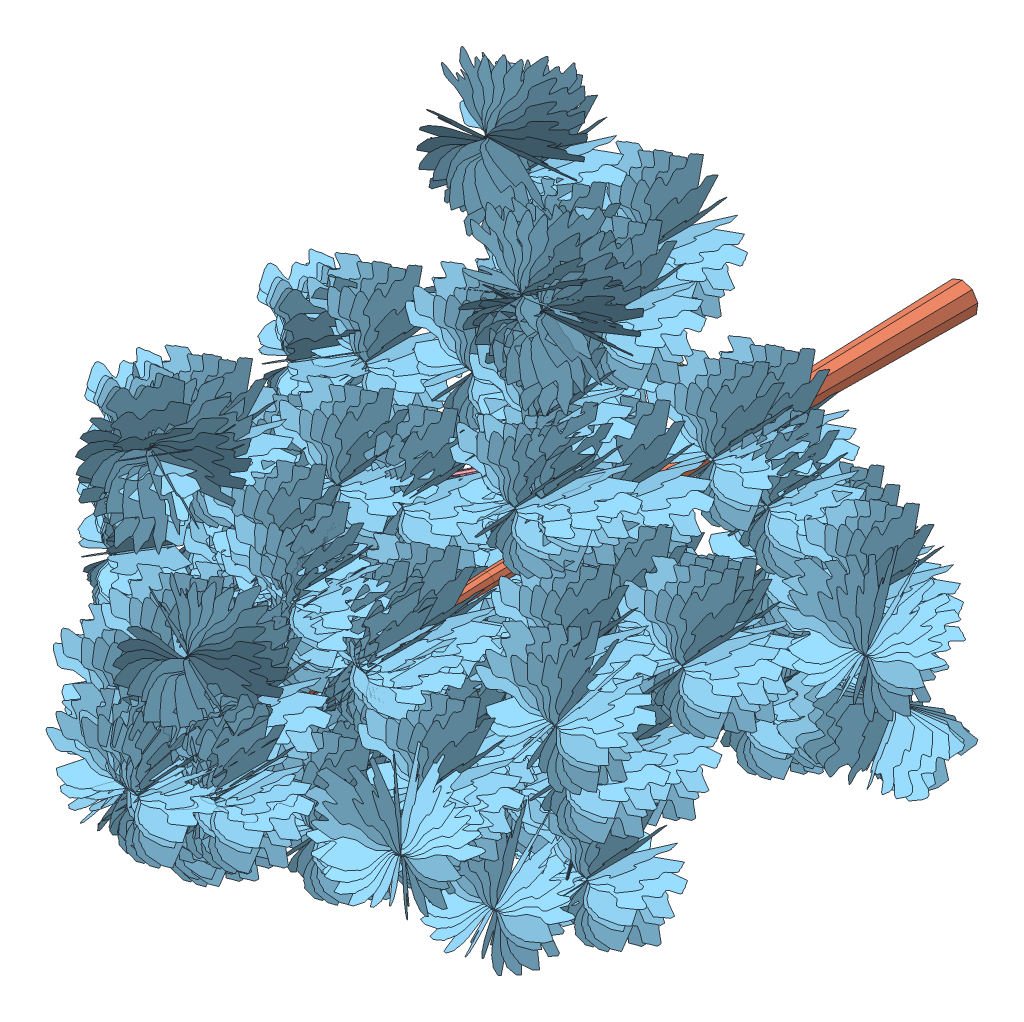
SolidWorks assembly Trees.sldasm, configuration Default (file format 5000). Lengths in mm.
Overall size (5115.62 5139.42 6788.33).
101 component instances, 5 part files, 0 mates.
Components (placement in the parent):
- ske23D-1: ske23D.sldasm [Default] at (-497.2906 -107.9055 -375.1821) size (2886.4 3755.53 5969.2)
  - trunk#1-1: trunk#1.sldprt [Default] at (784.9948 -772.8956 286.8127) x (-0.353553 0.612372 0.707107) z (0.353553 -0.612372 0.707107) size (412.95 799.64 2417.55)
  - trunk-1: trunk.sldprt [Default] at (279.3507 -134.9513 0.0105) size (239.05 254.8 5969.2)
  - trunk#1.003-1: trunk#1.003.sldprt [Default] at (335.3171 751.2508 -333.0644) x (-0.473959 -0.546062 0.690781) z (0.191833 0.701616 0.686247) size (412.95 799.64 2477.24)
  - trunk#1.006-1: trunk#1.006.sldprt [Default] at (-359.6606 -300.0581 111.819) x (0.866025 0 0.5) z (-0.5 0 0.866025) size (412.95 799.64 2865.24)
- Component#3-1: Component#3.sldprt [Default] at (-202.0016 -317.6253 3063.5759) size (1057.83 1130.53 472.26)
- Component#3-2: Component#3.sldprt [Default] at (-336.2489 -317.6253 3063.5759) x (0.965926 0 -0.258819) z (0.258819 0 0.965926) size (1057.83 1130.53 472.26)
- Component#3-3: Component#3.sldprt [Default] at (-199.8415 -326.0573 2845.5621) size (1057.83 1130.53 472.26)
- Component#3-4: Component#3.sldprt [Default] at (-218.4754 -566.1578 2737.9376) size (1057.83 1130.53 472.26)
- Component#3-5: Component#3.sldprt [Default] at (-210.7731 -636.3138 2687.2585) size (1057.83 1130.53 472.26)
- Component#3-6: Component#3.sldprt [Default] at (164.1784 -289.2611 2828.6491) size (1057.83 1130.53 472.26)
- Component#3-7: Component#3.sldprt [Default] at (39.4824 -289.2611 2828.6491) size (1057.83 1130.53 472.26)
- Component#3-8: Component#3.sldprt [Default] at (-210.7731 311.9722 2687.2585) x (1 0 0) z (0 0.866025 0.5) size (1057.83 1130.53 472.26)
- Component#3-9: Component#3.sldprt [Default] at (-210.7731 -133.4052 2321.8848) size (1057.83 1130.53 472.26)
- Component#3-10: Component#3.sldprt [Default] at (146.7954 -924.5314 2006.2702) size (1057.83 1130.53 472.26)
- Component#3-11: Component#3.sldprt [Default] at (906.1519 -578.8297 2214.8347) x (0.707107 0 -0.707107) z (0.707107 0 0.707107) size (1057.83 1130.53 472.26)
- Component#3-12: Component#3.sldprt [Default] at (-1200.8275 995.9938 2158.4783) x (0.866025 0 0.5) z (-0.5 0 0.866025) size (1057.83 1130.53 472.26)
- Component#3-13: Component#3.sldprt [Default] at (-1045.3644 1051.7898 2146.1318) x (1 0 0) z (0 0.866025 0.5) size (1057.83 1130.53 472.26)
- Component#3-14: Component#3.sldprt [Default] at (-232.1528 258.4818 1851.6728) size (1057.83 1130.53 472.26)
- Component#3-15: Component#3.sldprt [Default] at (-204.4631 411.5036 1838.2811) size (1057.83 1130.53 472.26)
- Component#3-16: Component#3.sldprt [Default] at (-449.856 513.0234 1772.2196) size (1057.83 1130.53 472.26)
- Component#3-17: Component#3.sldprt [Default] at (198.5006 14.4196 1663.8953) size (1057.83 1130.53 472.26)
- Component#3-18: Component#3.sldprt [Default] at (91.7277 64.7925 1659.3474) size (1057.83 1130.53 472.26)
- Component#3-19: Component#3.sldprt [Default] at (-1117.4846 864.812 1689.5383) size (1057.83 1130.53 472.26)
- Component#3-20: Component#3.sldprt [Default] at (-648.7094 -1111.0069 1752.5943) size (1057.83 1130.53 472.26)
- Component#3-21: Component#3.sldprt [Default] at (-931.9954 -415.5517 2478.0061) size (1057.83 1130.53 472.26)
- Component#3-22: Component#3.sldprt [Default] at (-681.011 -81.2738 2349.5717) size (1057.83 1130.53 472.26)
- Component#3-23: Component#3.sldprt [Default] at (-621.194 -302.2997 2175.8236) size (1057.83 1130.53 472.26)
- Component#3-24: Component#3.sldprt [Default] at (-659.1133 -359.6225 1927.6922) size (1057.83 1130.53 472.26)
- Component#3-25: Component#3.sldprt [Default] at (-680.4982 -296.1493 1888.5219) size (1057.83 1130.53 472.26)
- Component#3-26: Component#3.sldprt [Default] at (-980.252 131.0567 1314.5463) size (1057.83 1130.53 472.26)
- Component#3-27: Component#3.sldprt [Default] at (-1073.3474 -271.2521 1327.8158) size (1057.83 1130.53 472.26)
- Component#3-28: Component#3.sldprt [Default] at (-550.1073 -872.9062 1640.0106) size (1057.83 1130.53 472.26)
- Component#3-29: Component#3.sldprt [Default] at (-186.0282 -1045.0166 1576.5753) size (1057.83 1130.53 472.26)
- Component#3-30: Component#3.sldprt [Default] at (-479.5062 -797.6791 1306.7022) size (1057.83 1130.53 472.26)
- Component#3-31: Component#3.sldprt [Default] at (-576.679 -620.4605 1129.2896) size (1057.83 1130.53 472.26)
- Component#3-32: Component#3.sldprt [Default] at (425.5661 -560.2573 1247.1991) size (1057.83 1130.53 472.26)
- Component#3-33: Component#3.sldprt [Default] at (269.9568 -713.0318 1073.1987) size (1057.83 1130.53 472.26)
- Component#3-34: Component#3.sldprt [Default] at (777.6838 -458.146 1784.3995) size (1057.83 1130.53 472.26)
- Component#3-35: Component#3.sldprt [Default] at (-1990.7247 -408.9778 1428.4496) x (0.866025 0 0.5) z (-0.5 0 0.866025) size (1057.83 1130.53 472.26)
- Component#3-36: Component#3.sldprt [Default] at (-1703.4908 -289.2013 1133.2781) size (1057.83 1130.53 472.26)
- Component#3-37: Component#3.sldprt [Default] at (-613.8736 600.4401 1074.0216) size (1057.83 1130.53 472.26)
- Component#3-38: Component#3.sldprt [Default] at (-298.3752 528.0107 885.6024) size (1057.83 1130.53 472.26)
- Component#3-39: Component#3.sldprt [Default] at (-1244.9151 124.6328 886.8648) size (1057.83 1130.53 472.26)
- Component#3-40: Component#3.sldprt [Default] at (1115.0115 -138.1182 1126.0241) x (0.965926 0 -0.258819) z (0.258819 0 0.965926) size (1057.83 1130.53 472.26)
- Component#3-41: Component#3.sldprt [Default] at (-192.9496 -1390.0468 1077.6396) size (1057.83 1130.53 472.26)
- Component#3-42: Component#3.sldprt [Default] at (-175.1851 -1520.7807 974.1227) size (1057.83 1130.53 472.26)
- Component#3-43: Component#3.sldprt [Default] at (-367.6289 -1424.1613 677.5667) size (1057.83 1130.53 472.26)
- Component#3-44: Component#3.sldprt [Default] at (341.2525 -1904.7509 872.7832) x (0.866025 0 -0.5) z (0.5 0 0.866025) size (1057.83 1130.53 472.26)
- Component#3-45: Component#3.sldprt [Default] at (-338.3614 -1584.1737 151.3799) size (1057.83 1130.53 472.26)
- Component#3-46: Component#3.sldprt [Default] at (106.8366 -1397.9146 431.1227) size (1057.83 1130.53 472.26)
- Component#3-47: Component#3.sldprt [Default] at (395.616 -1339.2368 -154.1617) size (1057.83 1130.53 472.26)
- Component#3-48: Component#3.sldprt [Default] at (732.495 -1725.3862 454.604) size (1057.83 1130.53 472.26)
- Component#3-49: Component#3.sldprt [Default] at (836.1969 -816.1076 694.9767) size (1057.83 1130.53 472.26)
- Component#3-50: Component#3.sldprt [Default] at (844.9387 -11.5879 798.3338) size (1057.83 1130.53 472.26)
- Component#3-51: Component#3.sldprt [Default] at (172.7871 48.6991 1335.5246) size (1057.83 1130.53 472.26)
- Component#3-52: Component#3.sldprt [Default] at (333.7653 696.0804 622.823) size (1057.83 1130.53 472.26)
- Component#3-53: Component#3.sldprt [Default] at (454.9168 769.7642 533.2444) size (1057.83 1130.53 472.26)
- Component#3-54: Component#3.sldprt [Default] at (201.8325 1055.6153 329.4145) size (1057.83 1130.53 472.26)
- Component#3-55: Component#3.sldprt [Default] at (357.0686 1864.8639 440.0678) x (1 0 0) z (0 0.707107 0.707107) size (1057.83 1130.53 472.26)
- Component#3-56: Component#3.sldprt [Default] at (207.8486 1939.8417 443.4961) x (1 0 0) z (0 0.5 0.866025) size (1057.83 1130.53 472.26)
- Component#3-57: Component#3.sldprt [Default] at (275.4695 1584.5665 -150.6176) size (1057.83 1130.53 472.26)
- Component#3-58: Component#3.sldprt [Default] at (-692.6365 773.186 -61.0855) size (1057.83 1130.53 472.26)
- Component#3-59: Component#3.sldprt [Default] at (-196.7372 881.5078 -258.8496) size (1057.83 1130.53 472.26)
- Component#3-60: Component#3.sldprt [Default] at (-1796.9051 -480.4305 711.628) size (1057.83 1130.53 472.26)
- Component#3-61: Component#3.sldprt [Default] at (-1548.9435 395.6715 -81.1784) size (1057.83 1130.53 472.26)
- Component#3-62: Component#3.sldprt [Default] at (-1964.5321 225.0637 34.4787) x (0.866025 0 0.5) z (-0.5 0 0.866025) size (1057.83 1130.53 472.26)
- Component#3-63: Component#3.sldprt [Default] at (1317.79 -61.2779 285.4404) size (1057.83 1130.53 472.26)
- Component#3-64: Component#3.sldprt [Default] at (297.0859 341.6029 -195.0052) size (1057.83 1130.53 472.26)
- Component#3-65: Component#3.sldprt [Default] at (641.8536 -174.3879 132.7344) size (1057.83 1130.53 472.26)
- Component#3-66: Component#3.sldprt [Default] at (938.1509 -314.1139 -17.226) size (1057.83 1130.53 472.26)
- Component#3-67: Component#3.sldprt [Default] at (1972.6545 -1.2773 -426.4265) x (0.866025 0 -0.5) z (0.5 0 0.866025) size (1057.83 1130.53 472.26)
- Component#3-68: Component#3.sldprt [Default] at (1653.3862 9.4837 -803.2706) size (1057.83 1130.53 472.26)
- Component#3-69: Component#3.sldprt [Default] at (570.6479 486.7719 -701.5882) size (1057.83 1130.53 472.26)
- Component#3-70: Component#3.sldprt [Default] at (856.3189 230.242 -851.0073) size (1057.83 1130.53 472.26)
- Component#3-71: Component#3.sldprt [Default] at (841.2267 -537.9964 -335.939) size (1057.83 1130.53 472.26)
- Component#3-72: Component#3.sldprt [Default] at (-399.4097 871.0299 -565.4041) size (1057.83 1130.53 472.26)
- Component#3-73: Component#3.sldprt [Default] at (-754.6145 1032.3969 -741.0009) size (1057.83 1130.53 472.26)
- Component#3-74: Component#3.sldprt [Default] at (-1196.3889 1728.0852 -670.235) x (1 0 0) z (0 0.707107 0.707107) size (1057.83 1130.53 472.26)
- Component#3-75: Component#3.sldprt [Default] at (-1233.4975 1384.4838 -1032.7356) size (1057.83 1130.53 472.26)
- Component#3-76: Component#3.sldprt [Default] at (-1220.8721 201.2818 -931.0533) size (1057.83 1130.53 472.26)
- Component#3-77: Component#3.sldprt [Default] at (-1105.2664 567.4114 -1080.4724) size (1057.83 1130.53 472.26)
- Component#3-78: Component#3.sldprt [Default] at (-597.5714 -765.6116 470.4509) size (1057.83 1130.53 472.26)
- Component#3-79: Component#3.sldprt [Default] at (-991.1347 -434.0713 290.5259) size (1057.83 1130.53 472.26)
- Component#3-80: Component#3.sldprt [Default] at (-1350.5635 -590.4462 -232.2639) size (1057.83 1130.53 472.26)
- Component#3-81: Component#3.sldprt [Default] at (-1308.4213 -1035.9251 -378.0732) size (1057.83 1130.53 472.26)
- Component#3-82: Component#3.sldprt [Default] at (-1368.9875 -1723.2501 -627.2219) x (1 0 0) z (0 -0.866025 0.5) size (1057.83 1130.53 472.26)
- Component#3-83: Component#3.sldprt [Default] at (-298.0564 -1055.626 -587.4788) size (1057.83 1130.53 472.26)
- Component#3-84: Component#3.sldprt [Default] at (-792.0264 -1080.7272 -772.6836) size (1057.83 1130.53 472.26)
- Component#3-85: Component#3.sldprt [Default] at (484.1283 -1437.8887 -1073.4348) size (1057.83 1130.53 472.26)
- Component#3-86: Component#3.sldprt [Default] at (599.9819 -408.7942 -1097.8445) size (1057.83 1130.53 472.26)
- Component#3-87: Component#3.sldprt [Default] at (1267.1105 -1427.9754 -1186.746) x (1 0 0) z (0 -0.866025 0.5) size (1057.83 1130.53 472.26)
- Component#3-88: Component#3.sldprt [Default] at (659.5148 -1355.074 -1233.8159) size (1057.83 1130.53 472.26)
- Component#3-89: Component#3.sldprt [Default] at (565.6963 -872.4105 -1737.6027) size (1057.83 1130.53 472.26)
- Component#3-90: Component#3.sldprt [Default] at (-687.0856 909.8725 -1438.9841) size (1057.83 1130.53 472.26)
- Component#3-91: Component#3.sldprt [Default] at (-1254.6849 -1024.2359 -1229.3771) size (1057.83 1130.53 472.26)
- Component#3-92: Component#3.sldprt [Default] at (-328.7707 -1122.6587 -972.4507) size (1057.83 1130.53 472.26)
- Component#3-93: Component#3.sldprt [Default] at (145.5463 -1984.3771 118.2586) x (1 0 0) z (0 -0.5 0.866025) size (1057.83 1130.53 472.26)
- Component#3-94: Component#3.sldprt [Default] at (586.9868 412.4973 -1047.2512) size (1057.83 1130.53 472.26)
- Component#3-95: Component#3.sldprt [Default] at (320.1676 -923.8827 -1858.5243) size (1057.83 1130.53 472.26)
- Component#3-96: Component#3.sldprt [Default] at (-1290.7299 227.3754 -1336.543) size (1057.83 1130.53 472.26)
